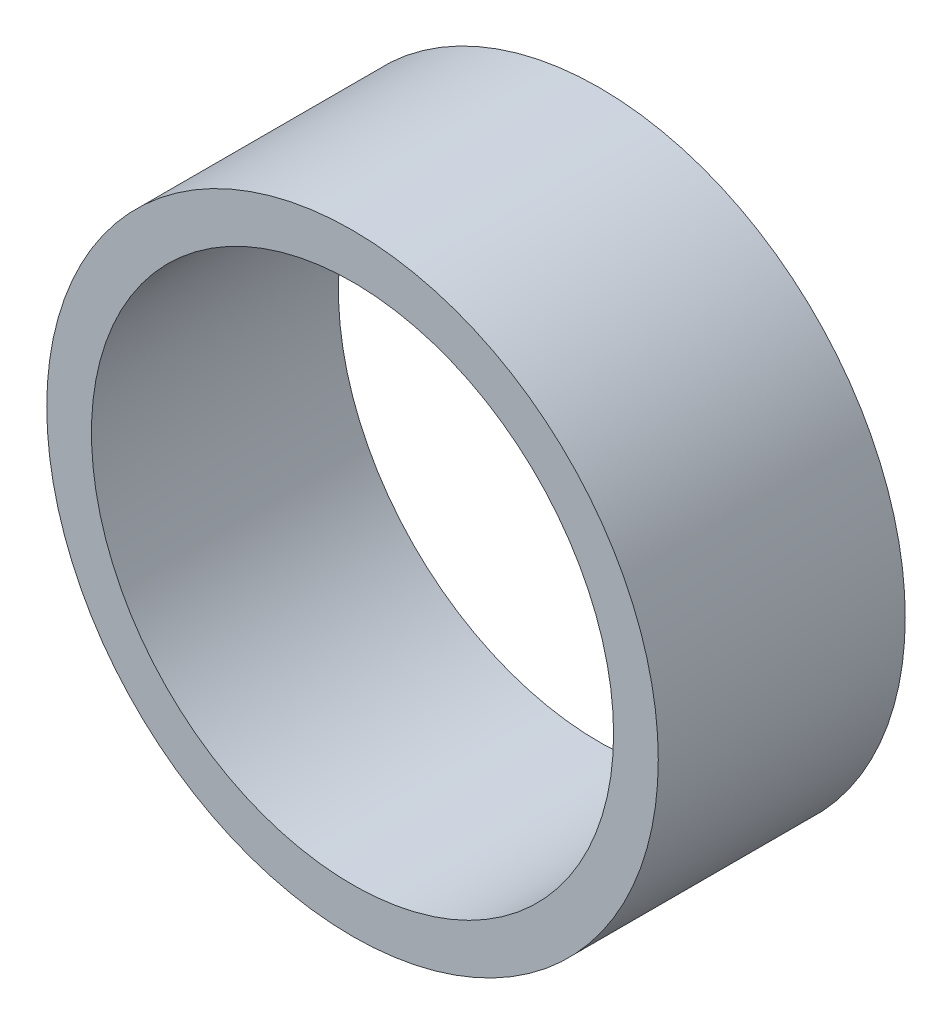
from build123d import *

# Parameters (mm, degrees)
SKETCH_1_R          = 13
EXTRUDE_1_DEPTH     = 10.5
SKETCH_2_R          = 11.1
CUT_EXTRUDE_1_DEPTH = 22.17191536


with BuildPart() as part:
    # Sketch 1 → Extrude 1 (new body)
    with BuildSketch(Plane.XY):
        Circle(SKETCH_1_R)
    extrude(amount=-EXTRUDE_1_DEPTH)

    # Sketch 2 → Cut-Extrude 1 (cut, through all)
    with BuildSketch(Plane.XY):
        Circle(SKETCH_2_R)
    extrude(amount=-CUT_EXTRUDE_1_DEPTH, mode=Mode.SUBTRACT)


solid = part.part
